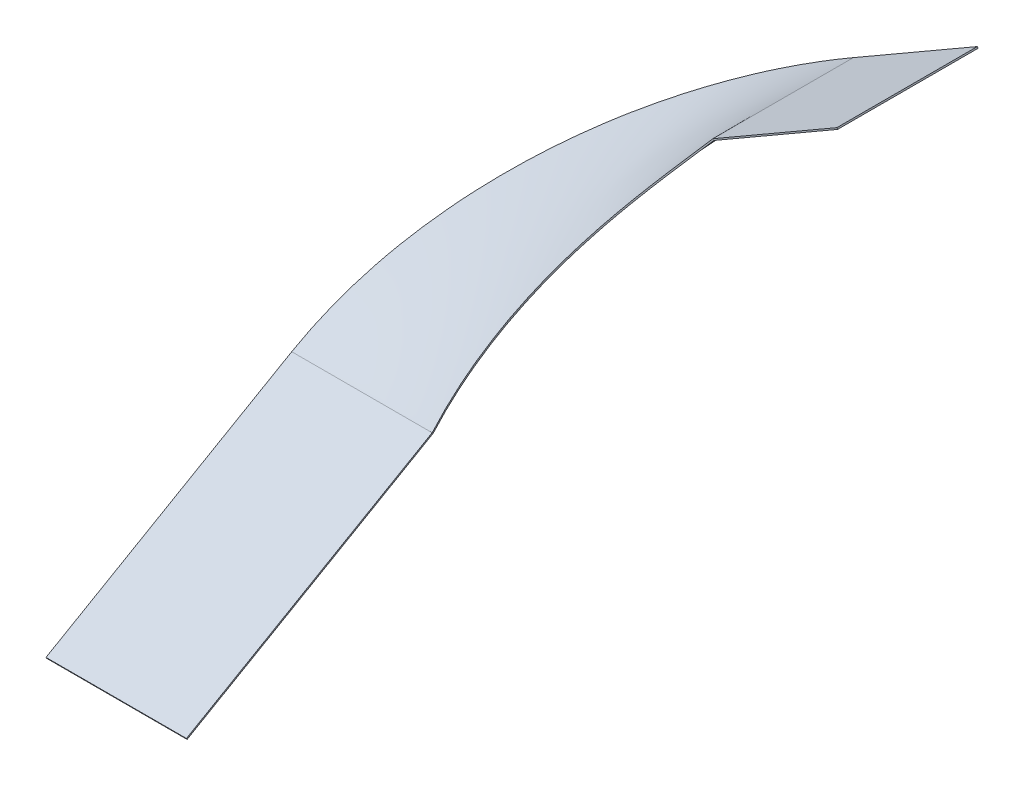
ISO-10303-21;
HEADER;
FILE_DESCRIPTION(('STEP AP214'),'2;1');
FILE_NAME('part.step','',(''),(''),'','','');
FILE_SCHEMA(('AUTOMOTIVE_DESIGN { 1 0 10303 214 1 1 1 1 }'));
ENDSEC;
DATA;
#1=APPLICATION_CONTEXT('core data for automotive mechanical design processes');
#2=APPLICATION_PROTOCOL_DEFINITION('international standard','automotive_design',2000,#1);
#3=PRODUCT_CONTEXT('',#1,'mechanical');
#4=PRODUCT('Part','Part','',(#3));
#5=PRODUCT_RELATED_PRODUCT_CATEGORY('part','',(#4));
#6=PRODUCT_DEFINITION_FORMATION('','',#4);
#7=PRODUCT_DEFINITION_CONTEXT('part definition',#1,'design');
#8=PRODUCT_DEFINITION('design','',#6,#7);
#9=PRODUCT_DEFINITION_SHAPE('','',#8);
#10=(LENGTH_UNIT() NAMED_UNIT(*) SI_UNIT(.MILLI.,.METRE.));
#11=(NAMED_UNIT(*) PLANE_ANGLE_UNIT() SI_UNIT($,.RADIAN.));
#12=(NAMED_UNIT(*) SI_UNIT($,.STERADIAN.) SOLID_ANGLE_UNIT());
#13=UNCERTAINTY_MEASURE_WITH_UNIT(LENGTH_MEASURE(1.E-05),#10,'distance_accuracy_value','');
#14=(GEOMETRIC_REPRESENTATION_CONTEXT(3) GLOBAL_UNCERTAINTY_ASSIGNED_CONTEXT((#13)) GLOBAL_UNIT_ASSIGNED_CONTEXT((#10,
#11,#12)) REPRESENTATION_CONTEXT('',''));
#15=CARTESIAN_POINT('',(0.,0.,0.));
#16=DIRECTION('',(0.,0.,1.));
#17=DIRECTION('',(1.,0.,0.));
#18=AXIS2_PLACEMENT_3D('',#15,#16,#17);
#19=CARTESIAN_POINT('',(-400.,0.,4.18977760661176E-12));
#20=DIRECTION('',(1.,0.,0.));
#21=DIRECTION('',(0.,-0.499989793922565,0.866031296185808));
#22=AXIS2_PLACEMENT_3D('',#19,#20,#21);
#23=PLANE('',#22);
#24=DIRECTION('',(0.,-0.866031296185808,-0.499989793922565));
#25=VECTOR('',#24,1.);
#26=CARTESIAN_POINT('',(-399.999999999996,-202.067094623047,350.000000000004));
#27=LINE('',#26,#25);
#28=CARTESIAN_POINT('',(-399.999999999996,-202.067094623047,350.000000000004));
#29=VERTEX_POINT('',#28);
#30=CARTESIAN_POINT('',(-399.999999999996,-203.799157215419,349.000020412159));
#31=VERTEX_POINT('',#30);
#32=EDGE_CURVE('E14',#29,#31,#27,.T.);
#33=ORIENTED_EDGE('',*,*,#32,.F.);
#34=DIRECTION('',(0.,-0.499989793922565,0.866031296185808));
#35=VECTOR('',#34,1.);
#36=CARTESIAN_POINT('',(-400.,0.,4.18977760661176E-12));
#37=LINE('',#36,#35);
#38=CARTESIAN_POINT('',(-400.,0.,4.18977760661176E-12));
#39=VERTEX_POINT('',#38);
#40=EDGE_CURVE('E235',#39,#29,#37,.T.);
#41=ORIENTED_EDGE('',*,*,#40,.F.);
#42=CARTESIAN_POINT('',(-400.,-1.73206259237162,-0.999979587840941));
#43=CARTESIAN_POINT('',(-400.,0.,4.18977760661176E-12));
#44=B_SPLINE_CURVE_WITH_KNOTS('',1,(#42,#43),.UNSPECIFIED.,.F.,.F.,(2,2),(0.,1.),.UNSPECIFIED.);
#45=CARTESIAN_POINT('',(-400.,-1.73206259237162,-0.999979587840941));
#46=VERTEX_POINT('',#45);
#47=EDGE_CURVE('E68',#39,#46,#44,.F.);
#48=ORIENTED_EDGE('',*,*,#47,.T.);
#49=DIRECTION('',(0.,0.499989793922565,-0.866031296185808));
#50=VECTOR('',#49,1.);
#51=CARTESIAN_POINT('',(-400.,-1.73206259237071,-0.999979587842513));
#52=LINE('',#51,#50);
#53=EDGE_CURVE('E228',#46,#31,#52,.F.);
#54=ORIENTED_EDGE('',*,*,#53,.T.);
#55=EDGE_LOOP('',(#33,#41,#48,#54));
#56=FACE_BOUND('',#55,.T.);
#57=ADVANCED_FACE('F58',(#56),#23,.F.);
#58=CARTESIAN_POINT('',(-400.,-1.73206259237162,-0.999979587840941));
#59=CARTESIAN_POINT('',(-399.967278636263,5.82438213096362,-14.0884819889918));
#60=CARTESIAN_POINT('',(-399.291473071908,13.3826519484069,-27.1785157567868));
#61=CARTESIAN_POINT('',(-396.660234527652,28.4971788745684,-53.2258772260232));
#62=CARTESIAN_POINT('',(-394.704915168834,36.0543588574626,-66.1847882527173));
#63=CARTESIAN_POINT('',(-386.946765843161,58.7263410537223,-104.680967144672));
#64=CARTESIAN_POINT('',(-379.248371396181,73.8408569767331,-129.835266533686));
#65=CARTESIAN_POINT('',(-359.08969025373,104.070019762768,-178.159099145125));
#66=CARTESIAN_POINT('',(-346.631515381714,119.184604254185,-201.328132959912));
#67=CARTESIAN_POINT('',(-317.432907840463,149.413771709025,-244.790852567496));
#68=CARTESIAN_POINT('',(-300.693827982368,164.528354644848,-265.084038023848));
#69=CARTESIAN_POINT('',(-263.577293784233,194.757521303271,-302.015455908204));
#70=CARTESIAN_POINT('',(-243.200667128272,209.872104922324,-318.652864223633));
#71=CARTESIAN_POINT('',(-199.592504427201,240.101271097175,-347.633796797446));
#72=CARTESIAN_POINT('',(-176.361465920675,255.21585754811,-359.975976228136));
#73=CARTESIAN_POINT('',(-127.93745291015,285.445017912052,-379.892789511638));
#74=CARTESIAN_POINT('',(-102.744966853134,300.559537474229,-387.465320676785));
#75=CARTESIAN_POINT('',(-64.2104887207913,323.23151636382,-395.030897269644));
#76=CARTESIAN_POINT('',(-51.241964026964,330.788695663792,-396.921398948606));
#77=CARTESIAN_POINT('',(-25.1817714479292,345.903223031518,-399.422368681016));
#78=CARTESIAN_POINT('',(-12.0885224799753,353.461492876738,-400.032721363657));
#79=CARTESIAN_POINT('',(0.999979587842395,361.017937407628,-400.));
#80=CARTESIAN_POINT('',(-400.,0.,4.18977760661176E-12));
#81=CARTESIAN_POINT('',(-400.,7.55644462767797,-13.0885022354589));
#82=CARTESIAN_POINT('',(-399.356920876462,15.1147144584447,-26.1801436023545));
#83=CARTESIAN_POINT('',(-396.79081673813,30.229241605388,-52.2339206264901));
#84=CARTESIAN_POINT('',(-394.86790621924,37.7864212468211,-65.1976384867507));
#85=CARTESIAN_POINT('',(-387.206043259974,60.4584017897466,-103.7129669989));
#86=CARTESIAN_POINT('',(-379.570580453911,75.5729195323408,-128.886359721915));
#87=CARTESIAN_POINT('',(-359.532833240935,105.802081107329,-177.260282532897));
#88=CARTESIAN_POINT('',(-347.132656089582,120.916666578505,-200.460318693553));
#89=CARTESIAN_POINT('',(-318.042886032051,151.14583339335,-243.995759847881));
#90=CARTESIAN_POINT('',(-301.354641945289,166.260416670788,-264.330665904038));
#91=CARTESIAN_POINT('',(-264.330665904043,196.489583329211,-301.354641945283));
#92=CARTESIAN_POINT('',(-243.995759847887,211.604166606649,-318.042886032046));
#93=CARTESIAN_POINT('',(-200.46031869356,241.833333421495,-347.132656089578));
#94=CARTESIAN_POINT('',(-177.260282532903,256.947918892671,-359.532833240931));
#95=CARTESIAN_POINT('',(-128.886359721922,287.177080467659,-379.570580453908));
#96=CARTESIAN_POINT('',(-103.712966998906,302.291598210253,-387.206043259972));
#97=CARTESIAN_POINT('',(-65.1976384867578,324.963578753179,-394.867906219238));
#98=CARTESIAN_POINT('',(-52.2339206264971,332.520758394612,-396.790816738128));
#99=CARTESIAN_POINT('',(-26.1801436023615,347.635285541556,-399.356920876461));
#100=CARTESIAN_POINT('',(-13.088502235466,355.193555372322,-400.));
#101=CARTESIAN_POINT('',(-2.7353854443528E-12,362.75,-400.));
#102=B_SPLINE_SURFACE_WITH_KNOTS('',1,3,((#58,#59,#60,#61,#62,#63,#64,#65,#66,#67,#68,#69,#70,
#71,#72,#73,#74,#75,#76,#77,#78,#79),(#80,#81,#82,#83,#84,#85,#86,#87,#88,#89,#90,#91,#92,#93,
#94,#95,#96,#97,#98,#99,#100,#101)),.UNSPECIFIED.,.F.,.F.,.F.,(2,2),(4,2,2,2,2,2,2,2,2,2,4),(0.,
1.),(0.,0.0625,0.125,0.25,0.375,0.5,0.625,0.75,0.875,0.9375,1.),.UNSPECIFIED.);
#103=CARTESIAN_POINT('',(-400.,0.,4.18977760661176E-12));
#104=CARTESIAN_POINT('',(-400.,7.55644462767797,-13.0885022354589));
#105=CARTESIAN_POINT('',(-399.356920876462,15.1147144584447,-26.1801436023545));
#106=CARTESIAN_POINT('',(-396.79081673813,30.229241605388,-52.2339206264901));
#107=CARTESIAN_POINT('',(-394.86790621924,37.7864212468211,-65.1976384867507));
#108=CARTESIAN_POINT('',(-387.206043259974,60.4584017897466,-103.7129669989));
#109=CARTESIAN_POINT('',(-379.570580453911,75.5729195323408,-128.886359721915));
#110=CARTESIAN_POINT('',(-359.532833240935,105.802081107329,-177.260282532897));
#111=CARTESIAN_POINT('',(-347.132656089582,120.916666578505,-200.460318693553));
#112=CARTESIAN_POINT('',(-318.042886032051,151.14583339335,-243.995759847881));
#113=CARTESIAN_POINT('',(-301.354641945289,166.260416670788,-264.330665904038));
#114=CARTESIAN_POINT('',(-264.330665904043,196.489583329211,-301.354641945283));
#115=CARTESIAN_POINT('',(-243.995759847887,211.604166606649,-318.042886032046));
#116=CARTESIAN_POINT('',(-200.46031869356,241.833333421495,-347.132656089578));
#117=CARTESIAN_POINT('',(-177.260282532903,256.947918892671,-359.532833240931));
#118=CARTESIAN_POINT('',(-128.886359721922,287.177080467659,-379.570580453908));
#119=CARTESIAN_POINT('',(-103.712966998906,302.291598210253,-387.206043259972));
#120=CARTESIAN_POINT('',(-65.1976384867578,324.963578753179,-394.867906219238));
#121=CARTESIAN_POINT('',(-52.2339206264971,332.520758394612,-396.790816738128));
#122=CARTESIAN_POINT('',(-26.1801436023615,347.635285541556,-399.356920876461));
#123=CARTESIAN_POINT('',(-13.088502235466,355.193555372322,-400.));
#124=CARTESIAN_POINT('',(-2.7353854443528E-12,362.75,-400.));
#125=B_SPLINE_CURVE_WITH_KNOTS('',3,(#103,#104,#105,#106,#107,#108,#109,#110,#111,#112,#113,
#114,#115,#116,#117,#118,#119,#120,#121,#122,#123,#124),.UNSPECIFIED.,.F.,.F.,(4,2,2,2,2,2,2,2,
2,2,4),(0.,0.0625,0.125,0.25,0.375,0.5,0.625,0.75,0.875,0.9375,1.),.UNSPECIFIED.);
#126=CARTESIAN_POINT('',(-2.7353854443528E-12,362.75,-400.));
#127=VERTEX_POINT('',#126);
#128=EDGE_CURVE('E157',#39,#127,#125,.T.);
#129=CARTESIAN_POINT('',(-2.7353854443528E-12,362.75,-400.));
#130=CARTESIAN_POINT('',(0.999979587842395,361.017937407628,-400.));
#131=B_SPLINE_CURVE_WITH_KNOTS('',1,(#129,#130),.UNSPECIFIED.,.F.,.F.,(2,2),(0.,1.),.UNSPECIFIED.);
#132=CARTESIAN_POINT('',(0.99997958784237,361.017937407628,-400.));
#133=VERTEX_POINT('',#132);
#134=EDGE_CURVE('E302',#127,#133,#131,.T.);
#135=CARTESIAN_POINT('',(-400.,-1.73206259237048,-0.999979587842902));
#136=CARTESIAN_POINT('',(-399.983740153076,2.04650879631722,-7.54484263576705));
#137=CARTESIAN_POINT('',(-399.80660936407,5.82508163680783,-14.0892934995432));
#138=CARTESIAN_POINT('',(-399.131579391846,13.3824084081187,-27.1619459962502));
#139=CARTESIAN_POINT('',(-398.633664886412,17.1611623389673,-33.6901468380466));
#140=CARTESIAN_POINT('',(-397.318068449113,24.7185206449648,-46.7139913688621));
#141=CARTESIAN_POINT('',(-396.500399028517,28.4971250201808,-53.2096363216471));
#142=CARTESIAN_POINT('',(-394.547327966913,36.0543807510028,-66.1530621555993));
#143=CARTESIAN_POINT('',(-393.411922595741,39.8330321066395,-72.6008424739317));
#144=CARTESIAN_POINT('',(-390.825807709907,47.390341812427,-85.4328556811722));
#145=CARTESIAN_POINT('',(-389.375098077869,51.1690001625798,-91.8170885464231));
#146=CARTESIAN_POINT('',(-386.162421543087,58.726298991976,-104.506735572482));
#147=CARTESIAN_POINT('',(-384.400455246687,62.5049394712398,-110.812149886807));
#148=CARTESIAN_POINT('',(-380.569595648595,70.0622227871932,-123.329031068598));
#149=CARTESIAN_POINT('',(-378.500702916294,73.8408656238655,-129.540498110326));
#150=CARTESIAN_POINT('',(-374.060356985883,81.3981511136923,-141.85434415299));
#151=CARTESIAN_POINT('',(-371.688903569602,85.1767937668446,-147.956723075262));
#152=CARTESIAN_POINT('',(-366.649157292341,92.7340841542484,-160.037644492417));
#153=CARTESIAN_POINT('',(-363.980864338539,96.512731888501,-166.016186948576));
#154=CARTESIAN_POINT('',(-358.354249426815,104.070022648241,-177.835204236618));
#155=CARTESIAN_POINT('',(-355.395927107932,107.848665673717,-183.675678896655));
#156=CARTESIAN_POINT('',(-349.196662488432,115.405955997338,-195.204656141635));
#157=CARTESIAN_POINT('',(-345.955720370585,119.184603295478,-200.893158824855));
#158=CARTESIAN_POINT('',(-339.198418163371,126.741896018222,-212.104165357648));
#159=CARTESIAN_POINT('',(-335.682058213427,130.520541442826,-217.626669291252));
#160=CARTESIAN_POINT('',(-328.382365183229,138.07783434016,-228.492315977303));
#161=CARTESIAN_POINT('',(-324.59903211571,141.856481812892,-233.835458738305));
#162=CARTESIAN_POINT('',(-316.774735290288,149.413773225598,-244.329661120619));
#163=CARTESIAN_POINT('',(-312.733771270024,153.192417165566,-249.480720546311));
#164=CARTESIAN_POINT('',(-304.404338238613,160.74970700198,-259.578679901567));
#165=CARTESIAN_POINT('',(-300.115869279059,164.528352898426,-264.525579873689));
#166=CARTESIAN_POINT('',(-291.301262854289,172.085645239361,-274.202900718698));
#167=CARTESIAN_POINT('',(-286.775125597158,175.864291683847,-278.93332178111));
#168=CARTESIAN_POINT('',(-277.495995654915,183.421584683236,-288.166172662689));
#169=CARTESIAN_POINT('',(-272.743002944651,187.200231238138,-292.668602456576));
#170=CARTESIAN_POINT('',(-263.021730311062,194.757522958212,-301.434713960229));
#171=CARTESIAN_POINT('',(-258.053450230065,198.536168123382,-305.698395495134));
#172=CARTESIAN_POINT('',(-247.913970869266,206.093457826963,-313.977235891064));
#173=CARTESIAN_POINT('',(-242.742771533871,209.872102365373,-317.992394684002));
#174=CARTESIAN_POINT('',(-232.209580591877,217.429394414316,-325.764123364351));
#175=CARTESIAN_POINT('',(-226.847589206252,221.208041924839,-329.520693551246));
#176=CARTESIAN_POINT('',(-215.945581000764,228.76533502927,-336.765968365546));
#177=CARTESIAN_POINT('',(-210.405564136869,232.543980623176,-340.254672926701));
#178=CARTESIAN_POINT('',(-199.160911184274,240.101272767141,-346.955837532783));
#179=CARTESIAN_POINT('',(-193.456275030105,243.879919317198,-350.168297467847));
#180=CARTESIAN_POINT('',(-181.896446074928,251.437209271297,-356.309841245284));
#181=CARTESIAN_POINT('',(-176.041253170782,255.215852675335,-359.238924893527));
#182=CARTESIAN_POINT('',(-164.194252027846,262.773144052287,-364.806375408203));
#183=CARTESIAN_POINT('',(-158.202443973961,266.551792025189,-367.444742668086));
#184=CARTESIAN_POINT('',(-146.096475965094,274.109082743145,-372.424022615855));
#185=CARTESIAN_POINT('',(-139.982316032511,277.887725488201,-374.764935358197));
#186=CARTESIAN_POINT('',(-127.646421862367,285.44501045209,-379.14365819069));
#187=CARTESIAN_POINT('',(-121.424687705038,289.223652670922,-381.181468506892));
#188=CARTESIAN_POINT('',(-108.888808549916,296.780935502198,-384.949697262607));
#189=CARTESIAN_POINT('',(-102.574663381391,300.559576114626,-386.680115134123));
#190=CARTESIAN_POINT('',(-89.8691126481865,308.116875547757,-389.82930472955));
#191=CARTESIAN_POINT('',(-83.4777069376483,311.895534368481,-391.248075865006));
#192=CARTESIAN_POINT('',(-70.6329256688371,319.452843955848,-393.770000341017));
#193=CARTESIAN_POINT('',(-64.1795501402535,323.231494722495,-394.873153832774));
#194=CARTESIAN_POINT('',(-51.2265220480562,330.788749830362,-396.761484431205));
#195=CARTESIAN_POINT('',(-44.7268700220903,334.567354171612,-397.546665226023));
#196=CARTESIAN_POINT('',(-31.696610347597,342.124712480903,-398.797126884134));
#197=CARTESIAN_POINT('',(-25.1660014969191,345.903466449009,-399.262395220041));
#198=CARTESIAN_POINT('',(-12.090137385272,353.460793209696,-399.872055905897));
#199=CARTESIAN_POINT('',(-5.54488283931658,357.239366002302,-400.016463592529));
#200=CARTESIAN_POINT('',(0.999979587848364,361.017937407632,-400.00000000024));
#201=B_SPLINE_CURVE_WITH_KNOTS('',3,(#135,#136,#137,#138,#139,#140,#141,#142,#143,#144,#145,
#146,#147,#148,#149,#150,#151,#152,#153,#154,#155,#156,#157,#158,#159,#160,#161,#162,#163,#164,
#165,#166,#167,#168,#169,#170,#171,#172,#173,#174,#175,#176,#177,#178,#179,#180,#181,#182,#183,
#184,#185,#186,#187,#188,#189,#190,#191,#192,#193,#194,#195,#196,#197,#198,#199,#200),
.UNSPECIFIED.,.F.,.F.,(4,2,2,2,2,2,2,2,2,2,2,2,2,2,2,2,2,2,2,2,2,2,2,2,2,2,2,2,2,2,2,2,4),(0.,
22.6702440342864,45.3415709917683,68.0120109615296,90.6827170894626,113.353431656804,
136.024102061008,158.694730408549,181.365375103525,204.036026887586,226.706706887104,
249.377372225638,272.048026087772,294.718678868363,317.389354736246,340.060025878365,
362.730677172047,385.401330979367,408.072001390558,430.742678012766,453.413328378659,
476.083984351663,498.754649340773,521.425329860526,544.095979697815,566.7666253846,
589.437254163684,612.107924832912,634.778638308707,657.449340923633,680.119780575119,
702.791107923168,725.461351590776),.UNSPECIFIED.);
#202=EDGE_CURVE('E230',#46,#133,#201,.T.);
#203=ORIENTED_EDGE('',*,*,#47,.F.);
#204=ORIENTED_EDGE('',*,*,#128,.T.);
#205=ORIENTED_EDGE('',*,*,#134,.T.);
#206=ORIENTED_EDGE('',*,*,#202,.F.);
#207=EDGE_LOOP('',(#203,#204,#205,#206));
#208=FACE_BOUND('',#207,.T.);
#209=ADVANCED_FACE('F261',(#208),#102,.T.);
#210=CARTESIAN_POINT('',(-2.7353854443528E-12,362.75,-400.));
#211=DIRECTION('',(0.,0.,1.));
#212=DIRECTION('',(0.866031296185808,0.499989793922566,0.));
#213=AXIS2_PLACEMENT_3D('',#210,#211,#212);
#214=PLANE('',#213);
#215=ORIENTED_EDGE('',*,*,#134,.F.);
#216=DIRECTION('',(0.866031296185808,0.499989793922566,0.));
#217=VECTOR('',#216,1.);
#218=CARTESIAN_POINT('',(-2.7353854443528E-12,362.75,-400.));
#219=LINE('',#218,#217);
#220=CARTESIAN_POINT('',(176.499999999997,464.649549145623,-400.000000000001));
#221=VERTEX_POINT('',#220);
#222=EDGE_CURVE('E144',#127,#221,#219,.T.);
#223=ORIENTED_EDGE('',*,*,#222,.T.);
#224=DIRECTION('',(0.499989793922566,-0.866031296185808,0.));
#225=VECTOR('',#224,1.);
#226=CARTESIAN_POINT('',(176.499999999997,464.649549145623,-400.000000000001));
#227=LINE('',#226,#225);
#228=CARTESIAN_POINT('',(177.499979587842,462.917486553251,-400.000000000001));
#229=VERTEX_POINT('',#228);
#230=EDGE_CURVE('E120',#221,#229,#227,.T.);
#231=ORIENTED_EDGE('',*,*,#230,.T.);
#232=DIRECTION('',(-0.866031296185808,-0.499989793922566,0.));
#233=VECTOR('',#232,1.);
#234=CARTESIAN_POINT('',(177.499979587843,462.917486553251,-400.));
#235=LINE('',#234,#233);
#236=EDGE_CURVE('E238',#133,#229,#235,.F.);
#237=ORIENTED_EDGE('',*,*,#236,.F.);
#238=EDGE_LOOP('',(#215,#223,#231,#237));
#239=FACE_BOUND('',#238,.T.);
#240=ADVANCED_FACE('F272',(#239),#214,.F.);
#241=CARTESIAN_POINT('',(176.499999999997,464.649549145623,-400.000000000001));
#242=DIRECTION('',(-0.866031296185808,-0.499989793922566,0.));
#243=DIRECTION('',(0.,0.,1.));
#244=AXIS2_PLACEMENT_3D('',#241,#242,#243);
#245=PLANE('',#244);
#246=ORIENTED_EDGE('',*,*,#230,.F.);
#247=DIRECTION('',(0.,0.,1.));
#248=VECTOR('',#247,1.);
#249=CARTESIAN_POINT('',(176.499999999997,464.649549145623,-400.000000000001));
#250=LINE('',#249,#248);
#251=CARTESIAN_POINT('',(176.499999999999,464.649549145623,-200.));
#252=VERTEX_POINT('',#251);
#253=EDGE_CURVE('E139',#221,#252,#250,.T.);
#254=ORIENTED_EDGE('',*,*,#253,.T.);
#255=DIRECTION('',(0.499989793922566,-0.866031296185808,0.));
#256=VECTOR('',#255,1.);
#257=CARTESIAN_POINT('',(176.499999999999,464.649549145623,-200.));
#258=LINE('',#257,#256);
#259=CARTESIAN_POINT('',(177.499979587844,462.917486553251,-200.));
#260=VERTEX_POINT('',#259);
#261=EDGE_CURVE('E126',#252,#260,#258,.T.);
#262=ORIENTED_EDGE('',*,*,#261,.T.);
#263=DIRECTION('',(0.,0.,1.));
#264=VECTOR('',#263,1.);
#265=CARTESIAN_POINT('',(177.499979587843,462.91748655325,-200.));
#266=LINE('',#265,#264);
#267=EDGE_CURVE('E234',#229,#260,#266,.T.);
#268=ORIENTED_EDGE('',*,*,#267,.F.);
#269=EDGE_LOOP('',(#246,#254,#262,#268));
#270=FACE_BOUND('',#269,.T.);
#271=ADVANCED_FACE('F146',(#270),#245,.F.);
#272=CARTESIAN_POINT('',(-1.41210164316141E-12,362.75,-200.));
#273=DIRECTION('',(0.,0.,1.));
#274=DIRECTION('',(0.866031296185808,0.499989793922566,0.));
#275=AXIS2_PLACEMENT_3D('',#272,#273,#274);
#276=PLANE('',#275);
#277=ORIENTED_EDGE('',*,*,#261,.F.);
#278=DIRECTION('',(0.866031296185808,0.499989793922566,0.));
#279=VECTOR('',#278,1.);
#280=CARTESIAN_POINT('',(-1.41210164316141E-12,362.75,-200.));
#281=LINE('',#280,#279);
#282=CARTESIAN_POINT('',(-1.41210164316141E-12,362.75,-200.));
#283=VERTEX_POINT('',#282);
#284=EDGE_CURVE('E129',#283,#252,#281,.T.);
#285=ORIENTED_EDGE('',*,*,#284,.F.);
#286=CARTESIAN_POINT('',(1.29148512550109,361.186236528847,-200.001543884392));
#287=CARTESIAN_POINT('',(1.2376733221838,361.251393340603,-200.001415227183));
#288=CARTESIAN_POINT('',(1.18386150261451,361.316550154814,-200.001294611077));
#289=CARTESIAN_POINT('',(1.0762378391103,361.446863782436,-200.001069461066));
#290=CARTESIAN_POINT('',(1.02242599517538,361.512020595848,-200.000964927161));
#291=CARTESIAN_POINT('',(0.914802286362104,361.642334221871,-200.000771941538));
#292=CARTESIAN_POINT('',(0.860990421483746,361.707491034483,-200.000683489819));
#293=CARTESIAN_POINT('',(0.753366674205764,361.837804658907,-200.000522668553));
#294=CARTESIAN_POINT('',(0.699554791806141,361.902961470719,-200.000450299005));
#295=CARTESIAN_POINT('',(0.591931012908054,362.033275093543,-200.000321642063));
#296=CARTESIAN_POINT('',(0.538119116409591,362.098431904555,-200.000265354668));
#297=CARTESIAN_POINT('',(0.430495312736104,362.228745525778,-200.000168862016));
#298=CARTESIAN_POINT('',(0.37668340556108,362.29390233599,-200.000128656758));
#299=CARTESIAN_POINT('',(0.269059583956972,362.424215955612,-200.00006432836));
#300=CARTESIAN_POINT('',(0.215247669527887,362.489372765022,-200.00004020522));
#301=CARTESIAN_POINT('',(0.107623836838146,362.619686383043,-200.00000804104));
#302=CARTESIAN_POINT('',(0.0538119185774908,362.684843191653,-200.));
#303=CARTESIAN_POINT('',(-1.41210164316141E-12,362.75,-200.));
#304=B_SPLINE_CURVE_WITH_KNOTS('',3,(#286,#287,#288,#289,#290,#291,#292,#293,#294,#295,#296,
#297,#298,#299,#300,#301,#302,#303),.UNSPECIFIED.,.F.,.F.,(4,2,2,2,2,2,2,2,4),(0.,
0.253515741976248,0.507031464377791,0.760547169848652,1.01406286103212,1.26757854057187,
1.52109421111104,1.77460987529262,2.02812553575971),.UNSPECIFIED.);
#305=CARTESIAN_POINT('',(1.29148265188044,361.186232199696,-200.0007721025));
#306=VERTEX_POINT('',#305);
#307=EDGE_CURVE('E133',#283,#306,#304,.F.);
#308=ORIENTED_EDGE('',*,*,#307,.T.);
#309=DIRECTION('',(-0.866031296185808,-0.499989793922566,0.));
#310=VECTOR('',#309,1.);
#311=CARTESIAN_POINT('',(177.499979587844,462.917486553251,-200.));
#312=LINE('',#311,#310);
#313=EDGE_CURVE('E131',#306,#260,#312,.F.);
#314=ORIENTED_EDGE('',*,*,#313,.T.);
#315=EDGE_LOOP('',(#277,#285,#308,#314));
#316=FACE_BOUND('',#315,.T.);
#317=ADVANCED_FACE('F128',(#316),#276,.T.);
#318=CARTESIAN_POINT('',(-200.02374665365,-4.93671870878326,1.6296580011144));
#319=CARTESIAN_POINT('',(-200.015831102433,-3.72758837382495,0.582491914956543));
#320=CARTESIAN_POINT('',(-200.007915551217,-2.51845803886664,-0.464674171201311));
#321=CARTESIAN_POINT('',(-200.,-1.30932770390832,-1.51184025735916));
#322=CARTESIAN_POINT('',(-199.901055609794,13.8048014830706,-14.6014163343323));
#323=CARTESIAN_POINT('',(-198.512939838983,28.9199172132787,-27.6818120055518));
#324=CARTESIAN_POINT('',(-193.210949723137,59.1489056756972,-53.3198035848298));
#325=CARTESIAN_POINT('',(-189.298122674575,74.2635822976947,-65.8777860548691));
#326=CARTESIAN_POINT('',(-179.096451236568,104.492762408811,-89.9890433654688));
#327=CARTESIAN_POINT('',(-172.808601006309,119.607339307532,-101.542141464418));
#328=CARTESIAN_POINT('',(-158.099168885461,149.836507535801,-123.199909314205));
#329=CARTESIAN_POINT('',(-149.678242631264,164.951090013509,-133.304321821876));
#330=CARTESIAN_POINT('',(-131.026319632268,195.180256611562,-151.676372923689));
#331=CARTESIAN_POINT('',(-120.795755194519,210.294840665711,-159.943584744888));
#332=CARTESIAN_POINT('',(-98.9180951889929,240.52400643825,-174.323921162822));
#333=CARTESIAN_POINT('',(-87.2712557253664,255.638587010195,-180.436400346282));
#334=CARTESIAN_POINT('',(-63.008536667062,285.867762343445,-190.272399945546));
#335=CARTESIAN_POINT('',(-50.3928247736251,300.982445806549,-193.994939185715));
#336=CARTESIAN_POINT('',(-24.6776229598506,331.211426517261,-198.908732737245));
#337=CARTESIAN_POINT('',(-11.5777340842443,346.32654511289,-200.098944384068));
#338=CARTESIAN_POINT('',(1.51184025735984,361.440672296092,-200.));
#339=CARTESIAN_POINT('',(-200.,-3.62739075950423,3.1414980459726));
#340=CARTESIAN_POINT('',(-200.,-2.41826050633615,2.0943320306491));
#341=CARTESIAN_POINT('',(-200.,-1.20913025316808,1.0471660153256));
#342=CARTESIAN_POINT('',(-200.,0.,2.09488880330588E-12));
#343=CARTESIAN_POINT('',(-200.,15.1141281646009,-13.0895751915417));
#344=CARTESIAN_POINT('',(-198.710836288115,30.2292453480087,-26.1797174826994));
#345=CARTESIAN_POINT('',(-193.602944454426,60.4582299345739,-51.8563141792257));
#346=CARTESIAN_POINT('',(-189.785261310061,75.5729099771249,-64.4431613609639));
#347=CARTESIAN_POINT('',(-179.766425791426,105.802087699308,-88.630149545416));
#348=CARTESIAN_POINT('',(-173.566261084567,120.916666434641,-100.230118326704));
#349=CARTESIAN_POINT('',(-159.021376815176,151.145833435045,-121.997832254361));
#350=CARTESIAN_POINT('',(-150.677307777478,166.260416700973,-132.16532072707));
#351=CARTESIAN_POINT('',(-132.165320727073,196.489583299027,-150.677307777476));
#352=CARTESIAN_POINT('',(-121.997832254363,211.604166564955,-159.021376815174));
#353=CARTESIAN_POINT('',(-100.230118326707,241.833333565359,-173.566261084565));
#354=CARTESIAN_POINT('',(-88.6301495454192,256.947912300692,-179.766425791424));
#355=CARTESIAN_POINT('',(-64.4431613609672,287.177090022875,-189.78526131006));
#356=CARTESIAN_POINT('',(-51.8563141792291,302.291770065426,-193.602944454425));
#357=CARTESIAN_POINT('',(-26.179717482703,332.520754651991,-198.710836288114));
#358=CARTESIAN_POINT('',(-13.0895751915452,347.635871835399,-200.));
#359=CARTESIAN_POINT('',(-1.41210164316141E-12,362.75,-200.));
#360=B_SPLINE_SURFACE_WITH_KNOTS('',1,3,((#318,#319,#320,#321,#322,#323,#324,#325,#326,#327,
#328,#329,#330,#331,#332,#333,#334,#335,#336,#337,#338),(#339,#340,#341,#342,#343,#344,#345,
#346,#347,#348,#349,#350,#351,#352,#353,#354,#355,#356,#357,#358,#359)),.UNSPECIFIED.,.F.,.F.,
.F.,(2,2),(4,3,2,2,2,2,2,2,2,4),(0.,1.),(-0.01,0.,0.125,0.25,0.375,0.5,0.625,0.75,0.875,1.),.UNSPECIFIED.);
#361=CARTESIAN_POINT('',(-1.41210164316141E-12,362.75,-200.));
#362=CARTESIAN_POINT('',(-13.0895751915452,347.635871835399,-200.));
#363=CARTESIAN_POINT('',(-26.179717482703,332.520754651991,-198.710836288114));
#364=CARTESIAN_POINT('',(-51.8563141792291,302.291770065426,-193.602944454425));
#365=CARTESIAN_POINT('',(-64.4431613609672,287.177090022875,-189.78526131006));
#366=CARTESIAN_POINT('',(-88.6301495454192,256.947912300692,-179.766425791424));
#367=CARTESIAN_POINT('',(-100.230118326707,241.833333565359,-173.566261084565));
#368=CARTESIAN_POINT('',(-121.997832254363,211.604166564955,-159.021376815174));
#369=CARTESIAN_POINT('',(-132.165320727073,196.489583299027,-150.677307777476));
#370=CARTESIAN_POINT('',(-150.677307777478,166.260416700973,-132.16532072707));
#371=CARTESIAN_POINT('',(-159.021376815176,151.145833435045,-121.997832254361));
#372=CARTESIAN_POINT('',(-173.566261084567,120.916666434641,-100.230118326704));
#373=CARTESIAN_POINT('',(-179.766425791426,105.802087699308,-88.630149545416));
#374=CARTESIAN_POINT('',(-189.785261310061,75.5729099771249,-64.4431613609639));
#375=CARTESIAN_POINT('',(-193.602944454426,60.4582299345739,-51.8563141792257));
#376=CARTESIAN_POINT('',(-198.710836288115,30.2292453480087,-26.1797174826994));
#377=CARTESIAN_POINT('',(-200.,15.1141281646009,-13.0895751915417));
#378=CARTESIAN_POINT('',(-200.,0.,2.09488880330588E-12));
#379=CARTESIAN_POINT('',(-200.,-1.20913025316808,1.0471660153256));
#380=CARTESIAN_POINT('',(-200.,-2.41826050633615,2.0943320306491));
#381=CARTESIAN_POINT('',(-200.,-3.62739075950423,3.1414980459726));
#382=B_SPLINE_CURVE_WITH_KNOTS('',3,(#361,#362,#363,#364,#365,#366,#367,#368,#369,#370,#371,
#372,#373,#374,#375,#376,#377,#378,#379,#380,#381),.UNSPECIFIED.,.F.,.F.,(4,2,2,2,2,2,2,2,3,4),
(-0.01,0.115,0.24,0.365,0.49,0.615,0.74,0.865,0.99,1.),.UNSPECIFIED.);
#383=CARTESIAN_POINT('',(-200.,0.,2.09488880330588E-12));
#384=VERTEX_POINT('',#383);
#385=EDGE_CURVE('E414',#283,#384,#382,.T.);
#386=CARTESIAN_POINT('',(-200.,0.,2.09488880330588E-12));
#387=CARTESIAN_POINT('',(-199.999999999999,-0.0651567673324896,-0.0538119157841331));
#388=CARTESIAN_POINT('',(-200.000008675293,-0.130313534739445,-0.107623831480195));
#389=CARTESIAN_POINT('',(-200.000043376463,-0.260627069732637,-0.215247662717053));
#390=CARTESIAN_POINT('',(-200.000069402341,-0.325783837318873,-0.269059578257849));
#391=CARTESIAN_POINT('',(-200.000138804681,-0.456097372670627,-0.376683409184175));
#392=CARTESIAN_POINT('',(-200.000182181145,-0.521254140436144,-0.430495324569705));
#393=CARTESIAN_POINT('',(-200.000286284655,-0.651567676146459,-0.538119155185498));
#394=CARTESIAN_POINT('',(-200.000347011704,-0.716724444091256,-0.591931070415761));
#395=CARTESIAN_POINT('',(-200.000485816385,-0.847037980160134,-0.699554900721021));
#396=CARTESIAN_POINT('',(-200.000563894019,-0.912194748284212,-0.753366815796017));
#397=CARTESIAN_POINT('',(-200.00073739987,-1.04250828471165,-0.860990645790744));
#398=CARTESIAN_POINT('',(-200.00083282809,-1.10766505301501,-0.914802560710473));
#399=CARTESIAN_POINT('',(-200.001041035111,-1.23797858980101,-1.02242639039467));
#400=CARTESIAN_POINT('',(-200.001153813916,-1.30313535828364,-1.07623830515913));
#401=CARTESIAN_POINT('',(-200.001396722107,-1.43344889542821,-1.18386213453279));
#402=CARTESIAN_POINT('',(-200.001526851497,-1.49860566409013,-1.23767404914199));
#403=CARTESIAN_POINT('',(-200.001665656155,-1.56376242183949,-1.29148595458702));
#404=B_SPLINE_CURVE_WITH_KNOTS('',3,(#386,#387,#388,#389,#390,#391,#392,#393,#394,#395,#396,
#397,#398,#399,#400,#401,#402,#403),.UNSPECIFIED.,.F.,.F.,(4,2,2,2,2,2,2,2,4),(0.,
0.253515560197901,0.50703113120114,0.760546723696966,1.01406234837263,1.26757801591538,
1.52109373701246,1.77460952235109,2.0281253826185),.UNSPECIFIED.);
#405=CARTESIAN_POINT('',(-200.000832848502,-1.56376777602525,-1.29148269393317));
#406=VERTEX_POINT('',#405);
#407=EDGE_CURVE('E76',#384,#406,#404,.T.);
#408=CARTESIAN_POINT('',(1.2914843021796,361.186235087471,-200.001544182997));
#409=CARTESIAN_POINT('',(-1.98094908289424,357.407690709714,-200.022726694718));
#410=CARTESIAN_POINT('',(-5.25389481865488,353.629145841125,-199.963457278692));
#411=CARTESIAN_POINT('',(-11.7931178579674,346.071851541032,-199.684462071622));
#412=CARTESIAN_POINT('',(-15.0593947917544,342.293102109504,-199.464727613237));
#413=CARTESIAN_POINT('',(-21.5771624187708,334.735683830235,-198.865253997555));
#414=CARTESIAN_POINT('',(-24.8286534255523,330.957014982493,-198.485518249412));
#415=CARTESIAN_POINT('',(-31.3090469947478,323.399721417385,-197.566959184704));
#416=CARTESIAN_POINT('',(-34.5379498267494,319.621096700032,-197.028137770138));
#417=CARTESIAN_POINT('',(-40.9653974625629,312.063835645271,-195.792566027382));
#418=CARTESIAN_POINT('',(-44.1639422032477,308.285199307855,-195.095815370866));
#419=CARTESIAN_POINT('',(-50.5230478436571,300.727914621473,-193.546347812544));
#420=CARTESIAN_POINT('',(-53.6836085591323,296.949266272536,-192.693630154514));
#421=CARTESIAN_POINT('',(-59.9591364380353,289.391963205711,-190.83430813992));
#422=CARTESIAN_POINT('',(-63.0741035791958,285.613308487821,-189.827703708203));
#423=CARTESIAN_POINT('',(-69.2508441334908,278.056005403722,-187.662726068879));
#424=CARTESIAN_POINT('',(-72.312617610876,274.277357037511,-186.504353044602));
#425=CARTESIAN_POINT('',(-78.3755651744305,266.720060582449,-184.038625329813));
#426=CARTESIAN_POINT('',(-81.3767393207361,262.941412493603,-182.731270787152));
#427=CARTESIAN_POINT('',(-87.311355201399,255.384119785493,-179.970930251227));
#428=CARTESIAN_POINT('',(-90.2447968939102,251.605475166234,-178.517944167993));
#429=CARTESIAN_POINT('',(-96.0369578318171,244.048184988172,-175.469979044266));
#430=CARTESIAN_POINT('',(-98.895677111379,240.269539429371,-173.8750000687));
#431=CARTESIAN_POINT('',(-104.531352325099,232.712248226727,-170.546593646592));
#432=CARTESIAN_POINT('',(-107.308308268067,228.933602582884,-168.813166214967));
#433=CARTESIAN_POINT('',(-112.773738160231,221.37631001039,-165.212031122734));
#434=CARTESIAN_POINT('',(-115.462212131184,217.597663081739,-163.344323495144));
#435=CARTESIAN_POINT('',(-120.74428356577,210.040370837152,-159.479244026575));
#436=CARTESIAN_POINT('',(-123.337880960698,206.261725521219,-157.481872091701));
#437=CARTESIAN_POINT('',(-128.424105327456,198.704434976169,-153.362461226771));
#438=CARTESIAN_POINT('',(-130.91673232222,194.925789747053,-151.240422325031));
#439=CARTESIAN_POINT('',(-135.794805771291,187.368498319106,-146.876532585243));
#440=CARTESIAN_POINT('',(-138.180252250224,183.589852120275,-144.634681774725));
#441=CARTESIAN_POINT('',(-142.83816099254,176.03255984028,-140.036530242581));
#442=CARTESIAN_POINT('',(-145.110623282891,172.253913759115,-137.680229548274));
#443=CARTESIAN_POINT('',(-149.537141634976,164.696621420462,-132.858918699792));
#444=CARTESIAN_POINT('',(-151.691197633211,160.917975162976,-130.39390848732));
#445=CARTESIAN_POINT('',(-155.875960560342,153.360684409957,-125.361316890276));
#446=CARTESIAN_POINT('',(-157.906667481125,149.582039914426,-122.793735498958));
#447=CARTESIAN_POINT('',(-161.839640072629,142.024748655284,-117.562018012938));
#448=CARTESIAN_POINT('',(-163.741905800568,138.246101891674,-114.897881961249));
#449=CARTESIAN_POINT('',(-167.413309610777,130.688809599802,-109.479404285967));
#450=CARTESIAN_POINT('',(-169.182447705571,126.91016407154,-106.725062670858));
#451=CARTESIAN_POINT('',(-172.583351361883,119.352871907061,-101.132839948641));
#452=CARTESIAN_POINT('',(-174.215116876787,115.574225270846,-98.2949588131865));
#453=CARTESIAN_POINT('',(-177.337640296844,108.016934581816,-92.5426494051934));
#454=CARTESIAN_POINT('',(-178.828398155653,104.238290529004,-89.6282211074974));
#455=CARTESIAN_POINT('',(-181.665152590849,96.6809987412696,-83.7297472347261));
#456=CARTESIAN_POINT('',(-183.011149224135,92.9023510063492,-80.7457016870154));
#457=CARTESIAN_POINT('',(-185.554956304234,85.3450548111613,-74.7150956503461));
#458=CARTESIAN_POINT('',(-186.752766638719,81.5664063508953,-71.6685351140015));
#459=CARTESIAN_POINT('',(-188.997322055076,74.0091022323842,-65.5202674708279));
#460=CARTESIAN_POINT('',(-190.044066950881,70.230446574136,-62.4185602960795));
#461=CARTESIAN_POINT('',(-191.98428639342,62.6731431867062,-56.1675719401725));
#462=CARTESIAN_POINT('',(-192.87776103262,58.8944954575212,-53.018290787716));
#463=CARTESIAN_POINT('',(-194.509229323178,51.3372129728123,-46.6797274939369));
#464=CARTESIAN_POINT('',(-195.247223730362,47.5585782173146,-43.490445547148));
#465=CARTESIAN_POINT('',(-196.565690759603,40.0013172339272,-37.0794863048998));
#466=CARTESIAN_POINT('',(-197.146163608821,36.2226910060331,-33.8578090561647));
#467=CARTESIAN_POINT('',(-198.148333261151,28.6653926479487,-27.3898132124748));
#468=CARTESIAN_POINT('',(-198.57002810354,24.8867205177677,-24.1434943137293));
#469=CARTESIAN_POINT('',(-199.253614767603,17.3292967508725,-17.6340067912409));
#470=CARTESIAN_POINT('',(-199.515503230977,13.5505451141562,-14.3708378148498));
#471=CARTESIAN_POINT('',(-199.87894505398,5.99327385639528,-7.83578253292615));
#472=CARTESIAN_POINT('',(-199.980508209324,2.21475423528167,-4.56389677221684));
#473=CARTESIAN_POINT('',(-200.0016656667,-1.56376420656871,-1.29148486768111));
#474=B_SPLINE_CURVE_WITH_KNOTS('',3,(#408,#409,#410,#411,#412,#413,#414,#415,#416,#417,#418,
#419,#420,#421,#422,#423,#424,#425,#426,#427,#428,#429,#430,#431,#432,#433,#434,#435,#436,#437,
#438,#439,#440,#441,#442,#443,#444,#445,#446,#447,#448,#449,#450,#451,#452,#453,#454,#455,#456,
#457,#458,#459,#460,#461,#462,#463,#464,#465,#466,#467,#468,#469,#470,#471,#472,#473),
.UNSPECIFIED.,.F.,.F.,(4,2,2,2,2,2,2,2,2,2,2,2,2,2,2,2,2,2,2,2,2,2,2,2,2,2,2,2,2,2,2,2,4),(0.,
14.9953475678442,29.991505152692,44.9873432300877,59.9830020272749,74.9786919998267,
89.974454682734,104.970224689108,119.96597658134,134.961713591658,149.957459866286,
164.953199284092,179.948937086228,194.944671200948,209.940416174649,224.936157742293,
239.931895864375,254.927630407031,269.923372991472,284.919116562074,299.91485345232,
314.910588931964,329.906329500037,344.902074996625,359.89781459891,374.893565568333,
389.889335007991,404.885095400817,419.880782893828,434.876448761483,449.872299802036,
464.8684659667,479.863715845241),.UNSPECIFIED.);
#475=EDGE_CURVE('E169',#306,#406,#474,.T.);
#476=ORIENTED_EDGE('',*,*,#307,.F.);
#477=ORIENTED_EDGE('',*,*,#385,.T.);
#478=ORIENTED_EDGE('',*,*,#407,.T.);
#479=ORIENTED_EDGE('',*,*,#475,.F.);
#480=EDGE_LOOP('',(#476,#477,#478,#479));
#481=FACE_BOUND('',#480,.T.);
#482=ADVANCED_FACE('F354',(#481),#360,.F.);
#483=CARTESIAN_POINT('',(-200.,0.,2.09488880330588E-12));
#484=DIRECTION('',(1.,0.,0.));
#485=DIRECTION('',(0.,-0.499989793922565,0.866031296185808));
#486=AXIS2_PLACEMENT_3D('',#483,#484,#485);
#487=PLANE('',#486);
#488=ORIENTED_EDGE('',*,*,#407,.F.);
#489=DIRECTION('',(0.,-0.499989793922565,0.866031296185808));
#490=VECTOR('',#489,1.);
#491=CARTESIAN_POINT('',(-200.,0.,2.09488880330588E-12));
#492=LINE('',#491,#490);
#493=CARTESIAN_POINT('',(-200.,-202.067094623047,350.000000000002));
#494=VERTEX_POINT('',#493);
#495=EDGE_CURVE('E156',#384,#494,#492,.T.);
#496=ORIENTED_EDGE('',*,*,#495,.T.);
#497=DIRECTION('',(0.,-0.866031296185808,-0.499989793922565));
#498=VECTOR('',#497,1.);
#499=CARTESIAN_POINT('',(-200.,-202.067094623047,350.000000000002));
#500=LINE('',#499,#498);
#501=CARTESIAN_POINT('',(-200.,-203.799157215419,349.000020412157));
#502=VERTEX_POINT('',#501);
#503=EDGE_CURVE('E62',#494,#502,#500,.T.);
#504=ORIENTED_EDGE('',*,*,#503,.T.);
#505=DIRECTION('',(0.,0.499989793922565,-0.866031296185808));
#506=VECTOR('',#505,1.);
#507=CARTESIAN_POINT('',(-200.,-1.73206259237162,-0.999979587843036));
#508=LINE('',#507,#506);
#509=EDGE_CURVE('E220',#406,#502,#508,.F.);
#510=ORIENTED_EDGE('',*,*,#509,.F.);
#511=EDGE_LOOP('',(#488,#496,#504,#510));
#512=FACE_BOUND('',#511,.T.);
#513=ADVANCED_FACE('F339',(#512),#487,.T.);
#514=CARTESIAN_POINT('',(-399.999999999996,-202.067094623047,350.000000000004));
#515=DIRECTION('',(0.,0.499989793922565,-0.866031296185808));
#516=DIRECTION('',(1.,0.,0.));
#517=AXIS2_PLACEMENT_3D('',#514,#515,#516);
#518=PLANE('',#517);
#519=DIRECTION('',(1.,0.,0.));
#520=VECTOR('',#519,1.);
#521=CARTESIAN_POINT('',(-399.999999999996,-202.067094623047,350.000000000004));
#522=LINE('',#521,#520);
#523=EDGE_CURVE('E150',#29,#494,#522,.T.);
#524=ORIENTED_EDGE('',*,*,#523,.F.);
#525=ORIENTED_EDGE('',*,*,#32,.T.);
#526=DIRECTION('',(1.,0.,0.));
#527=VECTOR('',#526,1.);
#528=CARTESIAN_POINT('',(-200.,-203.79915721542,349.000020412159));
#529=LINE('',#528,#527);
#530=EDGE_CURVE('E222',#31,#502,#529,.T.);
#531=ORIENTED_EDGE('',*,*,#530,.T.);
#532=ORIENTED_EDGE('',*,*,#503,.F.);
#533=EDGE_LOOP('',(#524,#525,#531,#532));
#534=FACE_BOUND('',#533,.T.);
#535=ADVANCED_FACE('F60',(#534),#518,.F.);
#536=CARTESIAN_POINT('',(-200.,-1.73206259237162,-0.999979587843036));
#537=DIRECTION('',(0.,-0.866031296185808,-0.499989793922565));
#538=DIRECTION('',(0.,0.499989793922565,-0.866031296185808));
#539=AXIS2_PLACEMENT_3D('',#536,#537,#538);
#540=PLANE('',#539);
#541=CARTESIAN_POINT('',(-399.999999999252,-1.73206259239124,-0.999979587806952));
#542=CARTESIAN_POINT('',(-399.935856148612,-1.73202787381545,-1.00003972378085));
#543=CARTESIAN_POINT('',(-399.871712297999,-1.73199314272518,-1.00009988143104));
#544=CARTESIAN_POINT('',(-399.742896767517,-1.73192336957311,-1.00022073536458));
#545=CARTESIAN_POINT('',(-399.678225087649,-1.73188832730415,-1.00028143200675));
#546=CARTESIAN_POINT('',(-399.354866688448,-1.73171305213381,-1.00058502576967));
#547=CARTESIAN_POINT('',(-399.096179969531,-1.73157262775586,-1.0008282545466));
#548=CARTESIAN_POINT('',(-397.802746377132,-1.73086948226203,-1.0020461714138));
#549=CARTESIAN_POINT('',(-396.767999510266,-1.73030369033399,-1.00302617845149));
#550=CARTESIAN_POINT('',(-391.594265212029,-1.72745802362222,-1.00795515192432));
#551=CARTESIAN_POINT('',(-387.455277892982,-1.72512802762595,-1.01199093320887));
#552=CARTESIAN_POINT('',(-366.760341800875,-1.71319570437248,-1.03265888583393));
#553=CARTESIAN_POINT('',(-350.204394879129,-1.70274634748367,-1.05075819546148));
#554=CARTESIAN_POINT('',(-322.432370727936,-1.68323546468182,-1.08455295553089));
#555=CARTESIAN_POINT('',(-311.216291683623,-1.67481334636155,-1.09914088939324));
#556=CARTESIAN_POINT('',(-283.241344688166,-1.65218121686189,-1.1383419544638));
#557=CARTESIAN_POINT('',(-266.482479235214,-1.63716775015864,-1.16434674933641));
#558=CARTESIAN_POINT('',(-241.344192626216,-1.61176290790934,-1.20835042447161));
#559=CARTESIAN_POINT('',(-232.964765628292,-1.60281385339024,-1.22385106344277));
#560=CARTESIAN_POINT('',(-216.205916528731,-1.58380673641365,-1.25677325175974));
#561=CARTESIAN_POINT('',(-207.826494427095,-1.57374867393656,-1.27419480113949));
#562=CARTESIAN_POINT('',(-199.447075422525,-1.56306237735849,-1.29270451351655));
#563=B_SPLINE_CURVE_WITH_KNOTS('',3,(#541,#542,#543,#544,#545,#546,#547,#548,#549,#550,#551,
#552,#553,#554,#555,#556,#557,#558,#559,#560,#561,#562),.UNSPECIFIED.,.F.,.F.,(4,2,2,2,2,2,2,2,
2,2,4),(0.,0.19243166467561,0.386446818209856,1.16250743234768,4.26674988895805,
16.6837197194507,66.3515993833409,99.9998743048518,150.276549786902,175.414887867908,
200.553226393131),.UNSPECIFIED.);
#564=EDGE_CURVE('E223',#46,#406,#563,.T.);
#565=ORIENTED_EDGE('',*,*,#564,.T.);
#566=ORIENTED_EDGE('',*,*,#509,.T.);
#567=ORIENTED_EDGE('',*,*,#530,.F.);
#568=ORIENTED_EDGE('',*,*,#53,.F.);
#569=EDGE_LOOP('',(#565,#566,#567,#568));
#570=FACE_BOUND('',#569,.T.);
#571=ADVANCED_FACE('F191',(#570),#540,.T.);
#572=CARTESIAN_POINT('',(-400.,-3.62697129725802,6.28226954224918));
#573=CARTESIAN_POINT('',(-198.,-3.62705817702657,3.10979866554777));
#574=CARTESIAN_POINT('',(-400.,-2.41798086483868,4.18817969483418));
#575=CARTESIAN_POINT('',(-198.,-2.41803878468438,2.07319911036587));
#576=CARTESIAN_POINT('',(-400.,-1.20899043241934,2.09408984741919));
#577=CARTESIAN_POINT('',(-198.,-1.20901939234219,1.03659955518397));
#578=CARTESIAN_POINT('',(-400.,5.25648014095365,-9.10473846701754));
#579=CARTESIAN_POINT('',(-198.,5.25660605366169,-4.50695458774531));
#580=CARTESIAN_POINT('',(-399.377854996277,15.772094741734,-27.3188091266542));
#581=CARTESIAN_POINT('',(-197.691981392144,15.7716459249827,-13.5224203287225));
#582=CARTESIAN_POINT('',(-396.582553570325,31.5433829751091,-54.5088524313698));
#583=CARTESIAN_POINT('',(-196.308273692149,31.543587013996,-26.9820479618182));
#584=CARTESIAN_POINT('',(-390.390083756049,52.5725295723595,-90.4247011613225));
#585=CARTESIAN_POINT('',(-193.243003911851,52.5723620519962,-44.7600626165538));
#586=CARTESIAN_POINT('',(-380.540027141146,73.601451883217,-125.579904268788));
#587=CARTESIAN_POINT('',(-188.367265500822,73.6014419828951,-62.1620241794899));
#588=CARTESIAN_POINT('',(-363.827292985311,99.8876798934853,-167.960482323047));
#589=CARTESIAN_POINT('',(-180.094527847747,99.8876840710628,-83.1404508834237));
#590=CARTESIAN_POINT('',(-347.030699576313,120.916666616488,-200.37643822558));
#591=CARTESIAN_POINT('',(-171.780130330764,120.916666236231,-99.1862972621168));
#592=CARTESIAN_POINT('',(-322.044942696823,147.202898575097,-238.470288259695));
#593=CARTESIAN_POINT('',(-159.41217555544,147.202898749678,-118.042742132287));
#594=CARTESIAN_POINT('',(-299.004444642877,168.231884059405,-266.790864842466));
#595=CARTESIAN_POINT('',(-148.007189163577,168.231884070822,-132.061465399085));
#596=CARTESIAN_POINT('',(-266.790864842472,194.518115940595,-299.004444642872));
#597=CARTESIAN_POINT('',(-132.061465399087,194.518115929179,-148.007189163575));
#598=CARTESIAN_POINT('',(-238.4702882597,215.547101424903,-322.044942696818));
#599=CARTESIAN_POINT('',(-118.04274213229,215.547101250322,-159.412175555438));
#600=CARTESIAN_POINT('',(-200.376438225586,241.833333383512,-347.030699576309));
#601=CARTESIAN_POINT('',(-99.1862972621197,241.83333376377,-171.780130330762));
#602=CARTESIAN_POINT('',(-167.960482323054,262.862320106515,-363.827292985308));
#603=CARTESIAN_POINT('',(-83.1404508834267,262.862315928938,-180.094527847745));
#604=CARTESIAN_POINT('',(-125.579904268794,289.148548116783,-380.540027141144));
#605=CARTESIAN_POINT('',(-62.1620241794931,289.148558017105,-188.367265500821));
#606=CARTESIAN_POINT('',(-90.4247011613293,310.177470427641,-390.390083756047));
#607=CARTESIAN_POINT('',(-44.7600626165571,310.177637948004,-193.243003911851));
#608=CARTESIAN_POINT('',(-54.5088524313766,331.206617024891,-396.582553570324));
#609=CARTESIAN_POINT('',(-26.9820479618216,331.206412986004,-196.308273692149));
#610=CARTESIAN_POINT('',(-27.318809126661,346.977905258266,-399.377854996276));
#611=CARTESIAN_POINT('',(-13.5224203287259,346.978354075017,-197.691981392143));
#612=CARTESIAN_POINT('',(-9.10473846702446,357.493519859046,-400.));
#613=CARTESIAN_POINT('',(-4.50695458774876,357.493393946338,-198.));
#614=CARTESIAN_POINT('',(-2.7353854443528E-12,362.75,-400.));
#615=CARTESIAN_POINT('',(-1.3988688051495E-12,362.75,-198.));
#616=B_SPLINE_SURFACE_WITH_KNOTS('',3,1,((#572,#573),(#574,#575),(#576,#577),(#578,#579),(#580,
#581),(#582,#583),(#584,#585),(#586,#587),(#588,#589),(#590,#591),(#592,#593),(#594,#595),(#596,
#597),(#598,#599),(#600,#601),(#602,#603),(#604,#605),(#606,#607),(#608,#609),(#610,#611),(#612,
#613),(#614,#615)),.UNSPECIFIED.,.F.,.F.,.F.,(4,2,1,1,1,1,1,1,1,1,1,1,1,1,1,1,1,1,4),(2,2),
(-0.01,0.,0.0434782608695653,0.0869565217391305,0.130434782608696,0.217391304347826,
0.260869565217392,0.347826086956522,0.391304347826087,0.478260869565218,0.521739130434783,
0.608695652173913,0.652173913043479,0.739130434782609,0.782608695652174,0.869565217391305,
0.91304347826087,0.956521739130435,1.),(0.,1.01),.UNSPECIFIED.);
#617=OFFSET_SURFACE('',#616,2.,.F.);
#618=ORIENTED_EDGE('',*,*,#202,.T.);
#619=CARTESIAN_POINT('',(0.999979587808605,361.017937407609,-399.999999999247));
#620=CARTESIAN_POINT('',(1.0000397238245,361.017972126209,-399.935855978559));
#621=CARTESIAN_POINT('',(1.00009988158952,361.018006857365,-399.871711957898));
#622=CARTESIAN_POINT('',(1.00022073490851,361.018076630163,-399.742897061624));
#623=CARTESIAN_POINT('',(1.00028143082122,361.01811167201,-399.678226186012));
#624=CARTESIAN_POINT('',(1.00058502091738,361.018286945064,-399.35487180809));
#625=CARTESIAN_POINT('',(1.00082824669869,361.018427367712,-399.096188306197));
#626=CARTESIAN_POINT('',(1.00204614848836,361.019130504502,-397.802770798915));
#627=CARTESIAN_POINT('',(1.00302614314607,361.019696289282,-396.768036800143));
#628=CARTESIAN_POINT('',(1.00795505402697,361.022541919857,-391.594366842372));
#629=CARTESIAN_POINT('',(1.01199078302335,361.024871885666,-387.455430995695));
#630=CARTESIAN_POINT('',(1.03265846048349,361.036804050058,-366.760752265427));
#631=CARTESIAN_POINT('',(1.05075750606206,361.047253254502,-350.2050112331));
#632=CARTESIAN_POINT('',(1.08455221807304,361.066764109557,-322.432918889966));
#633=CARTESIAN_POINT('',(1.09914047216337,361.075186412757,-311.216565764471));
#634=CARTESIAN_POINT('',(1.13834189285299,361.097818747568,-283.241344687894));
#635=CARTESIAN_POINT('',(1.16434666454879,361.11283220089,-266.482479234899));
#636=CARTESIAN_POINT('',(1.20835030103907,361.138237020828,-241.344192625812));
#637=CARTESIAN_POINT('',(1.22385092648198,361.147186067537,-232.964765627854));
#638=CARTESIAN_POINT('',(1.25677309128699,361.166193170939,-216.205916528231));
#639=CARTESIAN_POINT('',(1.27419463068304,361.176251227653,-207.826494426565));
#640=CARTESIAN_POINT('',(1.29270433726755,361.186937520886,-199.447075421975));
#641=B_SPLINE_CURVE_WITH_KNOTS('',3,(#619,#620,#621,#622,#623,#624,#625,#626,#627,#628,#629,
#630,#631,#632,#633,#634,#635,#636,#637,#638,#639,#640),.UNSPECIFIED.,.F.,.F.,(4,2,2,2,2,2,2,2,
2,2,4),(0.,0.192432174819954,0.386444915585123,1.16249587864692,4.26669973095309,
16.6835151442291,66.3507771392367,99.9998743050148,150.276549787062,175.414887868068,
200.553226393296),.UNSPECIFIED.);
#642=EDGE_CURVE('E219',#133,#306,#641,.T.);
#643=ORIENTED_EDGE('',*,*,#642,.T.);
#644=ORIENTED_EDGE('',*,*,#475,.T.);
#645=ORIENTED_EDGE('',*,*,#564,.F.);
#646=EDGE_LOOP('',(#618,#643,#644,#645));
#647=FACE_BOUND('',#646,.T.);
#648=ADVANCED_FACE('F179',(#647),#617,.T.);
#649=CARTESIAN_POINT('',(177.499979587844,462.917486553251,-200.));
#650=DIRECTION('',(-0.499989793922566,0.866031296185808,0.));
#651=DIRECTION('',(-0.866031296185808,-0.499989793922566,0.));
#652=AXIS2_PLACEMENT_3D('',#649,#650,#651);
#653=PLANE('',#652);
#654=ORIENTED_EDGE('',*,*,#267,.T.);
#655=ORIENTED_EDGE('',*,*,#313,.F.);
#656=ORIENTED_EDGE('',*,*,#642,.F.);
#657=ORIENTED_EDGE('',*,*,#236,.T.);
#658=EDGE_LOOP('',(#654,#655,#656,#657));
#659=FACE_BOUND('',#658,.T.);
#660=ADVANCED_FACE('F190',(#659),#653,.F.);
#661=CARTESIAN_POINT('',(-200.,0.,2.09488880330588E-12));
#662=DIRECTION('',(0.,-0.866031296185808,-0.499989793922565));
#663=DIRECTION('',(0.,0.499989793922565,-0.866031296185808));
#664=AXIS2_PLACEMENT_3D('',#661,#662,#663);
#665=PLANE('',#664);
#666=DIRECTION('',(1.,0.,0.));
#667=VECTOR('',#666,1.);
#668=CARTESIAN_POINT('',(-400.,0.,4.18977760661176E-12));
#669=LINE('',#668,#667);
#670=EDGE_CURVE('E152',#39,#384,#669,.T.);
#671=ORIENTED_EDGE('',*,*,#670,.F.);
#672=ORIENTED_EDGE('',*,*,#40,.T.);
#673=ORIENTED_EDGE('',*,*,#523,.T.);
#674=ORIENTED_EDGE('',*,*,#495,.F.);
#675=EDGE_LOOP('',(#671,#672,#673,#674));
#676=FACE_BOUND('',#675,.T.);
#677=ADVANCED_FACE('F331',(#676),#665,.F.);
#678=CARTESIAN_POINT('',(-400.,0.,4.18977760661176E-12));
#679=CARTESIAN_POINT('',(-200.,0.,2.09488880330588E-12));
#680=CARTESIAN_POINT('',(-400.,5.25648014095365,-9.10473846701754));
#681=CARTESIAN_POINT('',(-200.,5.25660480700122,-4.55247720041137));
#682=CARTESIAN_POINT('',(-399.377854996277,15.772094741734,-27.3188091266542));
#683=CARTESIAN_POINT('',(-199.688871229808,15.7716503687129,-13.6590182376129));
#684=CARTESIAN_POINT('',(-396.582553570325,31.5433829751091,-54.5088524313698));
#685=CARTESIAN_POINT('',(-198.291187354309,31.543584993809,-27.2545905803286));
#686=CARTESIAN_POINT('',(-390.390083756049,52.5725295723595,-90.4247011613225));
#687=CARTESIAN_POINT('',(-195.194955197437,52.5723637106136,-45.2121877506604));
#688=CARTESIAN_POINT('',(-380.540027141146,73.601451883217,-125.579904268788));
#689=CARTESIAN_POINT('',(-190.269966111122,73.6014420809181,-62.7899239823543));
#690=CARTESIAN_POINT('',(-363.827292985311,99.8876798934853,-167.960482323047));
#691=CARTESIAN_POINT('',(-181.913664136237,99.8876840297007,-83.9802531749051));
#692=CARTESIAN_POINT('',(-347.030699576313,120.916666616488,-200.37643822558));
#693=CARTESIAN_POINT('',(-173.51528448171,120.916666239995,-100.188179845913));
#694=CARTESIAN_POINT('',(-322.044942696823,147.202898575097,-238.470288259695));
#695=CARTESIAN_POINT('',(-161.022400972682,147.20289874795,-119.235094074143));
#696=CARTESIAN_POINT('',(-299.004444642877,168.231884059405,-266.790864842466));
#697=CARTESIAN_POINT('',(-149.502211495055,168.231884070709,-133.395419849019));
#698=CARTESIAN_POINT('',(-266.790864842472,194.518115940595,-299.004444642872));
#699=CARTESIAN_POINT('',(-133.395419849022,194.518115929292,-149.502211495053));
#700=CARTESIAN_POINT('',(-238.4702882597,215.547101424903,-322.044942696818));
#701=CARTESIAN_POINT('',(-119.235094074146,215.547101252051,-161.02240097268));
#702=CARTESIAN_POINT('',(-200.376438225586,241.833333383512,-347.030699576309));
#703=CARTESIAN_POINT('',(-100.188179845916,241.833333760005,-173.515284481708));
#704=CARTESIAN_POINT('',(-167.960482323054,262.862320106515,-363.827292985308));
#705=CARTESIAN_POINT('',(-83.9802531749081,262.8623159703,-181.913664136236));
#706=CARTESIAN_POINT('',(-125.579904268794,289.148548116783,-380.540027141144));
#707=CARTESIAN_POINT('',(-62.7899239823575,289.148557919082,-190.269966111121));
#708=CARTESIAN_POINT('',(-90.4247011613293,310.177470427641,-390.390083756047));
#709=CARTESIAN_POINT('',(-45.2121877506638,310.177636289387,-195.194955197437));
#710=CARTESIAN_POINT('',(-54.5088524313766,331.206617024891,-396.582553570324));
#711=CARTESIAN_POINT('',(-27.254590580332,331.206415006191,-198.291187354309));
#712=CARTESIAN_POINT('',(-27.318809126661,346.977905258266,-399.377854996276));
#713=CARTESIAN_POINT('',(-13.6590182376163,346.978349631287,-199.688871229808));
#714=CARTESIAN_POINT('',(-9.10473846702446,357.493519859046,-400.));
#715=CARTESIAN_POINT('',(-4.55247720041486,357.493395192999,-200.));
#716=CARTESIAN_POINT('',(-2.7353854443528E-12,362.75,-400.));
#717=CARTESIAN_POINT('',(-1.41210164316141E-12,362.75,-200.));
#718=B_SPLINE_SURFACE_WITH_KNOTS('',3,1,((#678,#679),(#680,#681),(#682,#683),(#684,#685),(#686,
#687),(#688,#689),(#690,#691),(#692,#693),(#694,#695),(#696,#697),(#698,#699),(#700,#701),(#702,
#703),(#704,#705),(#706,#707),(#708,#709),(#710,#711),(#712,#713),(#714,#715),(#716,#717)),
.UNSPECIFIED.,.F.,.F.,.F.,(4,1,1,1,1,1,1,1,1,1,1,1,1,1,1,1,1,4),(2,2),(0.,0.0434782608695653,
0.0869565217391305,0.130434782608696,0.217391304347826,0.260869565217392,0.347826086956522,
0.391304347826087,0.478260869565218,0.521739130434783,0.608695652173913,0.652173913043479,
0.739130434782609,0.782608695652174,0.869565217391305,0.91304347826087,0.956521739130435,1.),
(0.,1.),.UNSPECIFIED.);
#719=DIRECTION('',(0.,0.,1.));
#720=VECTOR('',#719,1.);
#721=CARTESIAN_POINT('',(-2.0737435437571E-12,362.75,-300.));
#722=LINE('',#721,#720);
#723=EDGE_CURVE('E142',#127,#283,#722,.T.);
#724=ORIENTED_EDGE('',*,*,#128,.F.);
#725=ORIENTED_EDGE('',*,*,#670,.T.);
#726=ORIENTED_EDGE('',*,*,#385,.F.);
#727=ORIENTED_EDGE('',*,*,#723,.F.);
#728=EDGE_LOOP('',(#724,#725,#726,#727));
#729=FACE_BOUND('',#728,.T.);
#730=ADVANCED_FACE('F333',(#729),#718,.F.);
#731=CARTESIAN_POINT('',(176.499999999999,464.649549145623,-200.));
#732=DIRECTION('',(-0.499989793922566,0.866031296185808,0.));
#733=DIRECTION('',(-0.866031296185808,-0.499989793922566,0.));
#734=AXIS2_PLACEMENT_3D('',#731,#732,#733);
#735=PLANE('',#734);
#736=ORIENTED_EDGE('',*,*,#253,.F.);
#737=ORIENTED_EDGE('',*,*,#222,.F.);
#738=ORIENTED_EDGE('',*,*,#723,.T.);
#739=ORIENTED_EDGE('',*,*,#284,.T.);
#740=EDGE_LOOP('',(#736,#737,#738,#739));
#741=FACE_BOUND('',#740,.T.);
#742=ADVANCED_FACE('F137',(#741),#735,.T.);
#743=CLOSED_SHELL('',(#57,#209,#240,#271,#317,#482,#513,#535,#571,#648,#660,#677,#730,#742));
#744=MANIFOLD_SOLID_BREP('B2',#743);
#745=ADVANCED_BREP_SHAPE_REPRESENTATION('',(#18,#744),#14);
#746=SHAPE_DEFINITION_REPRESENTATION(#9,#745);
ENDSEC;
END-ISO-10303-21;
